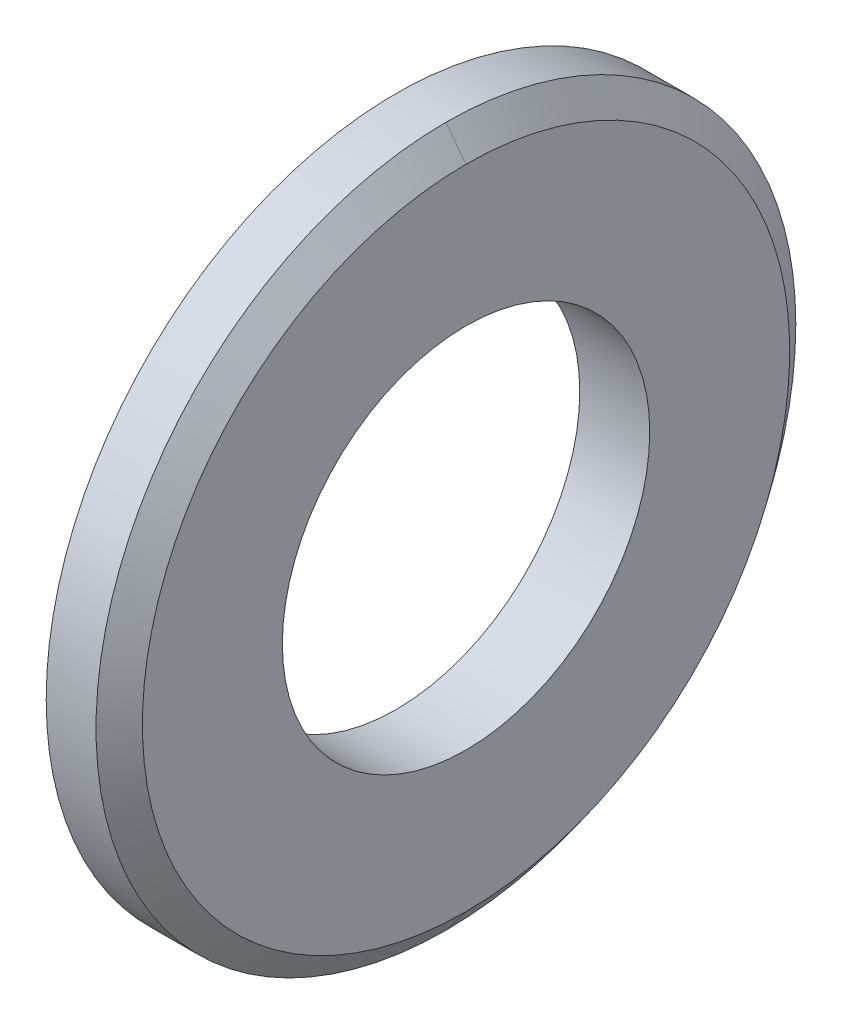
ISO-10303-21;
HEADER;
FILE_DESCRIPTION(('STEP AP214'),'2;1');
FILE_NAME('part.step','',(''),(''),'','','');
FILE_SCHEMA(('AUTOMOTIVE_DESIGN { 1 0 10303 214 1 1 1 1 }'));
ENDSEC;
DATA;
#1=APPLICATION_CONTEXT('core data for automotive mechanical design processes');
#2=APPLICATION_PROTOCOL_DEFINITION('international standard','automotive_design',2000,#1);
#3=PRODUCT_CONTEXT('',#1,'mechanical');
#4=PRODUCT('Part','Part','',(#3));
#5=PRODUCT_RELATED_PRODUCT_CATEGORY('part','',(#4));
#6=PRODUCT_DEFINITION_FORMATION('','',#4);
#7=PRODUCT_DEFINITION_CONTEXT('part definition',#1,'design');
#8=PRODUCT_DEFINITION('design','',#6,#7);
#9=PRODUCT_DEFINITION_SHAPE('','',#8);
#10=(LENGTH_UNIT() NAMED_UNIT(*) SI_UNIT(.MILLI.,.METRE.));
#11=(NAMED_UNIT(*) PLANE_ANGLE_UNIT() SI_UNIT($,.RADIAN.));
#12=(NAMED_UNIT(*) SI_UNIT($,.STERADIAN.) SOLID_ANGLE_UNIT());
#13=UNCERTAINTY_MEASURE_WITH_UNIT(LENGTH_MEASURE(1.E-05),#10,'distance_accuracy_value','');
#14=(GEOMETRIC_REPRESENTATION_CONTEXT(3) GLOBAL_UNCERTAINTY_ASSIGNED_CONTEXT((#13)) GLOBAL_UNIT_ASSIGNED_CONTEXT((#10,
#11,#12)) REPRESENTATION_CONTEXT('',''));
#15=CARTESIAN_POINT('',(0.,0.,0.));
#16=DIRECTION('',(0.,0.,1.));
#17=DIRECTION('',(1.,0.,0.));
#18=AXIS2_PLACEMENT_3D('',#15,#16,#17);
#19=CARTESIAN_POINT('',(1.42450475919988,0.,0.));
#20=DIRECTION('',(-1.,0.,0.));
#21=DIRECTION('',(0.,0.,1.));
#22=AXIS2_PLACEMENT_3D('',#19,#20,#21);
#23=CONICAL_SURFACE('',#22,9.99999999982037,0.916297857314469);
#24=DIRECTION('',(0.608761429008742,0.793353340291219,-6.46371844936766E-13));
#25=VECTOR('',#24,1.);
#26=CARTESIAN_POINT('',(-401419.053057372,-523151.351536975,4.2621195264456E-07));
#27=LINE('',#26,#25);
#28=CARTESIAN_POINT('',(2.00000000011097,-9.24999999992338,-4.82154635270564E-12));
#29=VERTEX_POINT('',#28);
#30=CARTESIAN_POINT('',(1.42450475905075,-9.99999999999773,-3.38523065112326E-12));
#31=VERTEX_POINT('',#30);
#32=EDGE_CURVE('E41',#29,#31,#27,.F.);
#33=ORIENTED_EDGE('',*,*,#32,.F.);
#34=CARTESIAN_POINT('',(2.00000000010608,0.,0.));
#35=DIRECTION('',(-1.,0.,0.));
#36=DIRECTION('',(0.,0.,1.));
#37=AXIS2_PLACEMENT_3D('',#34,#35,#36);
#38=CIRCLE('',#37,9.24999999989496);
#39=CARTESIAN_POINT('',(2.00000000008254,9.25000000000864,-2.60978504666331E-11));
#40=VERTEX_POINT('',#39);
#41=EDGE_CURVE('E54',#40,#29,#38,.F.);
#42=ORIENTED_EDGE('',*,*,#41,.F.);
#43=DIRECTION('',(0.608761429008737,-0.793353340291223,1.38633549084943E-12));
#44=VECTOR('',#43,1.);
#45=CARTESIAN_POINT('',(-401419.053057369,523151.351536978,-9.14184298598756E-07));
#46=LINE('',#45,#44);
#47=CARTESIAN_POINT('',(1.42450475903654,10.0000000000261,-6.85256641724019E-12));
#48=VERTEX_POINT('',#47);
#49=EDGE_CURVE('E47',#48,#40,#46,.T.);
#50=ORIENTED_EDGE('',*,*,#49,.F.);
#51=CARTESIAN_POINT('',(1.42450475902,0.,0.));
#52=DIRECTION('',(1.,0.,0.));
#53=DIRECTION('',(0.,0.,-1.));
#54=AXIS2_PLACEMENT_3D('',#51,#52,#53);
#55=CIRCLE('',#54,10.);
#56=EDGE_CURVE('E33',#31,#48,#55,.F.);
#57=ORIENTED_EDGE('',*,*,#56,.F.);
#58=EDGE_LOOP('',(#33,#42,#50,#57));
#59=FACE_BOUND('',#58,.T.);
#60=ADVANCED_FACE('F16',(#59),#23,.T.);
#61=CARTESIAN_POINT('',(1.42450475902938,0.,0.));
#62=DIRECTION('',(-1.,0.,0.));
#63=DIRECTION('',(0.,0.,1.));
#64=AXIS2_PLACEMENT_3D('',#61,#62,#63);
#65=CONICAL_SURFACE('',#64,10.0000000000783,0.916297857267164);
#66=ORIENTED_EDGE('',*,*,#49,.T.);
#67=CARTESIAN_POINT('',(2.000000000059,0.,0.));
#68=DIRECTION('',(-1.,0.,0.));
#69=DIRECTION('',(0.,0.,1.));
#70=AXIS2_PLACEMENT_3D('',#67,#68,#69);
#71=CIRCLE('',#70,9.25000000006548);
#72=EDGE_CURVE('E19',#29,#40,#71,.F.);
#73=ORIENTED_EDGE('',*,*,#72,.F.);
#74=ORIENTED_EDGE('',*,*,#32,.T.);
#75=CARTESIAN_POINT('',(1.42450475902,0.,0.));
#76=DIRECTION('',(1.,0.,0.));
#77=DIRECTION('',(0.,0.,-1.));
#78=AXIS2_PLACEMENT_3D('',#75,#76,#77);
#79=CIRCLE('',#78,10.);
#80=EDGE_CURVE('E50',#48,#31,#79,.F.);
#81=ORIENTED_EDGE('',*,*,#80,.F.);
#82=EDGE_LOOP('',(#66,#73,#74,#81));
#83=FACE_BOUND('',#82,.T.);
#84=ADVANCED_FACE('F49',(#83),#65,.T.);
#85=CARTESIAN_POINT('',(2.,0.,0.));
#86=DIRECTION('',(1.,0.,0.));
#87=DIRECTION('',(0.,0.,-1.));
#88=AXIS2_PLACEMENT_3D('',#85,#86,#87);
#89=PLANE('',#88);
#90=CARTESIAN_POINT('',(2.,0.,0.));
#91=DIRECTION('',(1.,0.,0.));
#92=DIRECTION('',(0.,0.,-1.));
#93=AXIS2_PLACEMENT_3D('',#90,#91,#92);
#94=CIRCLE('',#93,5.25);
#95=CARTESIAN_POINT('',(2.,0.,-5.25));
#96=VERTEX_POINT('',#95);
#97=EDGE_CURVE('E57',#96,#96,#94,.F.);
#98=ORIENTED_EDGE('',*,*,#97,.T.);
#99=EDGE_LOOP('',(#98));
#100=FACE_BOUND('',#99,.T.);
#101=ORIENTED_EDGE('',*,*,#72,.T.);
#102=ORIENTED_EDGE('',*,*,#41,.T.);
#103=EDGE_LOOP('',(#101,#102));
#104=FACE_BOUND('',#103,.T.);
#105=ADVANCED_FACE('F53',(#100,#104),#89,.T.);
#106=CARTESIAN_POINT('',(1.,0.,0.));
#107=DIRECTION('',(1.,0.,0.));
#108=DIRECTION('',(0.,0.,-1.));
#109=AXIS2_PLACEMENT_3D('',#106,#107,#108);
#110=CYLINDRICAL_SURFACE('',#109,10.);
#111=CARTESIAN_POINT('',(0.,0.,0.));
#112=DIRECTION('',(1.,0.,0.));
#113=DIRECTION('',(0.,0.,-1.));
#114=AXIS2_PLACEMENT_3D('',#111,#112,#113);
#115=CIRCLE('',#114,10.);
#116=CARTESIAN_POINT('',(0.,0.,-10.));
#117=VERTEX_POINT('',#116);
#118=EDGE_CURVE('E25',#117,#117,#115,.T.);
#119=ORIENTED_EDGE('',*,*,#118,.T.);
#120=EDGE_LOOP('',(#119));
#121=FACE_BOUND('',#120,.T.);
#122=ORIENTED_EDGE('',*,*,#80,.T.);
#123=ORIENTED_EDGE('',*,*,#56,.T.);
#124=EDGE_LOOP('',(#122,#123));
#125=FACE_BOUND('',#124,.T.);
#126=ADVANCED_FACE('F71',(#121,#125),#110,.T.);
#127=CARTESIAN_POINT('',(1.,0.,0.));
#128=DIRECTION('',(1.,0.,0.));
#129=DIRECTION('',(0.,0.,-1.));
#130=AXIS2_PLACEMENT_3D('',#127,#128,#129);
#131=CYLINDRICAL_SURFACE('',#130,5.25);
#132=CARTESIAN_POINT('',(0.,0.,0.));
#133=DIRECTION('',(1.,0.,0.));
#134=DIRECTION('',(0.,0.,-1.));
#135=AXIS2_PLACEMENT_3D('',#132,#133,#134);
#136=CIRCLE('',#135,5.25);
#137=CARTESIAN_POINT('',(0.,0.,-5.25));
#138=VERTEX_POINT('',#137);
#139=EDGE_CURVE('E11',#138,#138,#136,.F.);
#140=ORIENTED_EDGE('',*,*,#139,.T.);
#141=EDGE_LOOP('',(#140));
#142=FACE_BOUND('',#141,.T.);
#143=ORIENTED_EDGE('',*,*,#97,.F.);
#144=EDGE_LOOP('',(#143));
#145=FACE_BOUND('',#144,.T.);
#146=ADVANCED_FACE('F73',(#142,#145),#131,.F.);
#147=CARTESIAN_POINT('',(0.,0.,0.));
#148=DIRECTION('',(1.,0.,0.));
#149=DIRECTION('',(0.,0.,-1.));
#150=AXIS2_PLACEMENT_3D('',#147,#148,#149);
#151=PLANE('',#150);
#152=ORIENTED_EDGE('',*,*,#139,.F.);
#153=EDGE_LOOP('',(#152));
#154=FACE_BOUND('',#153,.T.);
#155=ORIENTED_EDGE('',*,*,#118,.F.);
#156=EDGE_LOOP('',(#155));
#157=FACE_BOUND('',#156,.T.);
#158=ADVANCED_FACE('F81',(#154,#157),#151,.F.);
#159=CLOSED_SHELL('',(#60,#84,#105,#126,#146,#158));
#160=MANIFOLD_SOLID_BREP('B1',#159);
#161=ADVANCED_BREP_SHAPE_REPRESENTATION('',(#18,#160),#14);
#162=SHAPE_DEFINITION_REPRESENTATION(#9,#161);
ENDSEC;
END-ISO-10303-21;
